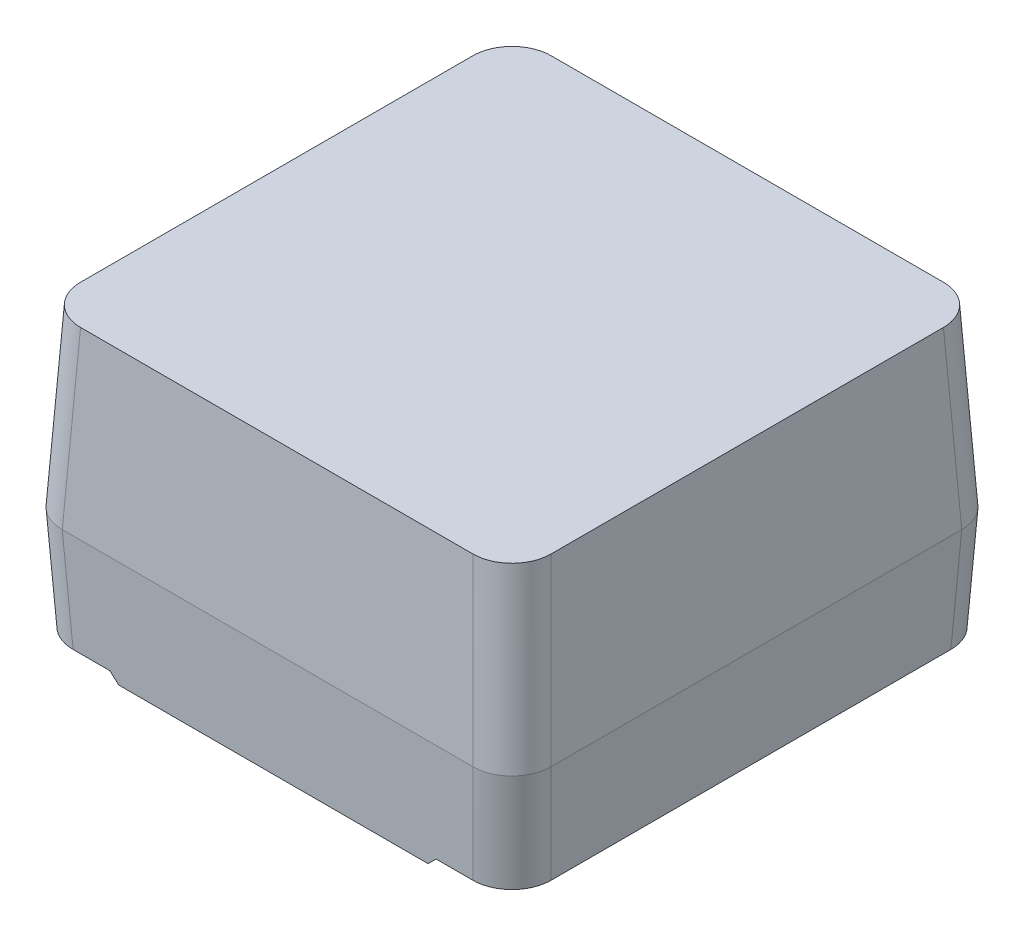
ISO-10303-21;
HEADER;
FILE_DESCRIPTION(('STEP AP214'),'2;1');
FILE_NAME('part.step','',(''),(''),'','','');
FILE_SCHEMA(('AUTOMOTIVE_DESIGN { 1 0 10303 214 1 1 1 1 }'));
ENDSEC;
DATA;
#1=APPLICATION_CONTEXT('core data for automotive mechanical design processes');
#2=APPLICATION_PROTOCOL_DEFINITION('international standard','automotive_design',2000,#1);
#3=PRODUCT_CONTEXT('',#1,'mechanical');
#4=PRODUCT('Part','Part','',(#3));
#5=PRODUCT_RELATED_PRODUCT_CATEGORY('part','',(#4));
#6=PRODUCT_DEFINITION_FORMATION('','',#4);
#7=PRODUCT_DEFINITION_CONTEXT('part definition',#1,'design');
#8=PRODUCT_DEFINITION('design','',#6,#7);
#9=PRODUCT_DEFINITION_SHAPE('','',#8);
#10=(LENGTH_UNIT() NAMED_UNIT(*) SI_UNIT(.MILLI.,.METRE.));
#11=(NAMED_UNIT(*) PLANE_ANGLE_UNIT() SI_UNIT($,.RADIAN.));
#12=(NAMED_UNIT(*) SI_UNIT($,.STERADIAN.) SOLID_ANGLE_UNIT());
#13=UNCERTAINTY_MEASURE_WITH_UNIT(LENGTH_MEASURE(1.E-05),#10,'distance_accuracy_value','');
#14=(GEOMETRIC_REPRESENTATION_CONTEXT(3) GLOBAL_UNCERTAINTY_ASSIGNED_CONTEXT((#13)) GLOBAL_UNIT_ASSIGNED_CONTEXT((#10,
#11,#12)) REPRESENTATION_CONTEXT('',''));
#15=CARTESIAN_POINT('',(0.,0.,0.));
#16=DIRECTION('',(0.,0.,1.));
#17=DIRECTION('',(1.,0.,0.));
#18=AXIS2_PLACEMENT_3D('',#15,#16,#17);
#19=CARTESIAN_POINT('',(-5.1435,0.,5.1435));
#20=DIRECTION('',(-0.998629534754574,-0.0523359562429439,0.));
#21=DIRECTION('',(0.052335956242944,-0.998629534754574,0.));
#22=AXIS2_PLACEMENT_3D('',#19,#20,#21);
#23=PLANE('',#22);
#24=DIRECTION('',(0.,0.,1.));
#25=VECTOR('',#24,1.);
#26=CARTESIAN_POINT('',(-5.02902044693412,-2.1844,5.1435));
#27=LINE('',#26,#25);
#28=CARTESIAN_POINT('',(-5.02902044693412,-2.1844,4.20465176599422));
#29=VERTEX_POINT('',#28);
#30=CARTESIAN_POINT('',(-5.02902044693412,-2.1844,-4.20465176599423));
#31=VERTEX_POINT('',#30);
#32=EDGE_CURVE('E175',#29,#31,#27,.F.);
#33=ORIENTED_EDGE('',*,*,#32,.F.);
#34=DIRECTION('',(0.052264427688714,-0.997264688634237,-0.0522644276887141));
#35=VECTOR('',#34,1.);
#36=CARTESIAN_POINT('',(-5.14575182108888,0.0429673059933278,4.32138314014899));
#37=LINE('',#36,#35);
#38=CARTESIAN_POINT('',(-5.1435,0.,4.3191313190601));
#39=VERTEX_POINT('',#38);
#40=EDGE_CURVE('E240',#29,#39,#37,.F.);
#41=ORIENTED_EDGE('',*,*,#40,.T.);
#42=DIRECTION('',(0.,0.,1.));
#43=VECTOR('',#42,1.);
#44=CARTESIAN_POINT('',(-5.1435,0.,5.1435));
#45=LINE('',#44,#43);
#46=CARTESIAN_POINT('',(-5.1435,0.,-4.3191313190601));
#47=VERTEX_POINT('',#46);
#48=EDGE_CURVE('E187',#47,#39,#45,.T.);
#49=ORIENTED_EDGE('',*,*,#48,.F.);
#50=DIRECTION('',(0.052264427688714,-0.997264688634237,0.0522644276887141));
#51=VECTOR('',#50,1.);
#52=CARTESIAN_POINT('',(-5.11765215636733,-0.493206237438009,-4.29328347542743));
#53=LINE('',#52,#51);
#54=EDGE_CURVE('E237',#47,#31,#53,.T.);
#55=ORIENTED_EDGE('',*,*,#54,.T.);
#56=EDGE_LOOP('',(#33,#41,#49,#55));
#57=FACE_BOUND('',#56,.T.);
#58=ADVANCED_FACE('F33',(#57),#23,.T.);
#59=CARTESIAN_POINT('',(-4.32138314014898,0.0861706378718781,4.32138314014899));
#60=DIRECTION('',(-0.052264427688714,0.997264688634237,0.052264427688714));
#61=DIRECTION('',(0.,-0.0523359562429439,0.998629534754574));
#62=AXIS2_PLACEMENT_3D('',#59,#60,#61);
#63=CYLINDRICAL_SURFACE('',#62,0.8255);
#64=ORIENTED_EDGE('',*,*,#40,.F.);
#65=CARTESIAN_POINT('',(-4.20238757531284,-2.1844,4.20238757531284));
#66=DIRECTION('',(0.,-1.,0.));
#67=DIRECTION('',(-0.707106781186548,0.,0.707106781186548));
#68=AXIS2_PLACEMENT_3D('',#65,#66,#67);
#69=ELLIPSE('',#68,0.82776419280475,0.8255);
#70=CARTESIAN_POINT('',(-4.20465176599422,-2.1844,5.02902044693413));
#71=VERTEX_POINT('',#70);
#72=EDGE_CURVE('E177',#29,#71,#69,.F.);
#73=ORIENTED_EDGE('',*,*,#72,.T.);
#74=DIRECTION('',(0.0522644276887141,-0.997264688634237,-0.052264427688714));
#75=VECTOR('',#74,1.);
#76=CARTESIAN_POINT('',(-4.32138314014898,0.0429673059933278,5.14575182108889));
#77=LINE('',#76,#75);
#78=CARTESIAN_POINT('',(-4.3191313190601,0.,5.1435));
#79=VERTEX_POINT('',#78);
#80=EDGE_CURVE('E211',#79,#71,#77,.T.);
#81=ORIENTED_EDGE('',*,*,#80,.F.);
#82=CARTESIAN_POINT('',(-4.31686712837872,0.,4.31686712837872));
#83=DIRECTION('',(0.,-1.,0.));
#84=DIRECTION('',(-0.707106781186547,0.,0.707106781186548));
#85=AXIS2_PLACEMENT_3D('',#82,#83,#84);
#86=ELLIPSE('',#85,0.82776419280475,0.8255);
#87=EDGE_CURVE('E258',#79,#39,#86,.T.);
#88=ORIENTED_EDGE('',*,*,#87,.T.);
#89=EDGE_LOOP('',(#64,#73,#81,#88));
#90=FACE_BOUND('',#89,.T.);
#91=ADVANCED_FACE('F291',(#90),#63,.T.);
#92=CARTESIAN_POINT('',(-4.32138314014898,0.0861706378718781,-4.32138314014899));
#93=DIRECTION('',(-0.052264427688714,0.997264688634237,-0.052264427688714));
#94=DIRECTION('',(0.,0.0523359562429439,0.998629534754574));
#95=AXIS2_PLACEMENT_3D('',#92,#93,#94);
#96=CYLINDRICAL_SURFACE('',#95,0.8255);
#97=DIRECTION('',(0.0522644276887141,-0.997264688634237,0.052264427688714));
#98=VECTOR('',#97,1.);
#99=CARTESIAN_POINT('',(-4.32138314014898,0.0429673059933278,-5.14575182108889));
#100=LINE('',#99,#98);
#101=CARTESIAN_POINT('',(-4.20465176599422,-2.1844,-5.02902044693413));
#102=VERTEX_POINT('',#101);
#103=CARTESIAN_POINT('',(-4.3191313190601,0.,-5.1435));
#104=VERTEX_POINT('',#103);
#105=EDGE_CURVE('E249',#102,#104,#100,.F.);
#106=ORIENTED_EDGE('',*,*,#105,.F.);
#107=CARTESIAN_POINT('',(-4.20238757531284,-2.1844,-4.20238757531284));
#108=DIRECTION('',(0.,-1.,0.));
#109=DIRECTION('',(-0.707106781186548,0.,-0.707106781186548));
#110=AXIS2_PLACEMENT_3D('',#107,#108,#109);
#111=ELLIPSE('',#110,0.82776419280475,0.8255);
#112=EDGE_CURVE('E267',#102,#31,#111,.F.);
#113=ORIENTED_EDGE('',*,*,#112,.T.);
#114=ORIENTED_EDGE('',*,*,#54,.F.);
#115=CARTESIAN_POINT('',(-4.31686712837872,0.,-4.31686712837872));
#116=DIRECTION('',(0.,-1.,0.));
#117=DIRECTION('',(-0.707106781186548,0.,-0.707106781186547));
#118=AXIS2_PLACEMENT_3D('',#115,#116,#117);
#119=ELLIPSE('',#118,0.82776419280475,0.8255);
#120=EDGE_CURVE('E261',#47,#104,#119,.T.);
#121=ORIENTED_EDGE('',*,*,#120,.T.);
#122=EDGE_LOOP('',(#106,#113,#114,#121));
#123=FACE_BOUND('',#122,.T.);
#124=ADVANCED_FACE('F308',(#123),#96,.T.);
#125=CARTESIAN_POINT('',(-5.1435,0.,5.1435));
#126=DIRECTION('',(-0.998629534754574,0.0523359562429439,0.));
#127=DIRECTION('',(-0.052335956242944,-0.998629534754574,0.));
#128=AXIS2_PLACEMENT_3D('',#125,#126,#127);
#129=PLANE('',#128);
#130=ORIENTED_EDGE('',*,*,#48,.T.);
#131=DIRECTION('',(0.052264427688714,0.997264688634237,-0.0522644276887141));
#132=VECTOR('',#131,1.);
#133=CARTESIAN_POINT('',(-5.14575182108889,-0.0429673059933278,4.32138314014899));
#134=LINE('',#133,#132);
#135=CARTESIAN_POINT('',(-4.95048214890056,3.683,4.12611346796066));
#136=VERTEX_POINT('',#135);
#137=EDGE_CURVE('E244',#39,#136,#134,.T.);
#138=ORIENTED_EDGE('',*,*,#137,.T.);
#139=DIRECTION('',(0.,0.,-1.));
#140=VECTOR('',#139,1.);
#141=CARTESIAN_POINT('',(-4.95048214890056,3.683,5.1435));
#142=LINE('',#141,#140);
#143=CARTESIAN_POINT('',(-4.95048214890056,3.683,-4.12611346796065));
#144=VERTEX_POINT('',#143);
#145=EDGE_CURVE('E199',#144,#136,#142,.F.);
#146=ORIENTED_EDGE('',*,*,#145,.F.);
#147=DIRECTION('',(0.052264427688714,0.997264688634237,0.052264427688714));
#148=VECTOR('',#147,1.);
#149=CARTESIAN_POINT('',(-5.11765215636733,0.493206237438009,-4.29328347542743));
#150=LINE('',#149,#148);
#151=EDGE_CURVE('E242',#144,#47,#150,.F.);
#152=ORIENTED_EDGE('',*,*,#151,.T.);
#153=EDGE_LOOP('',(#130,#138,#146,#152));
#154=FACE_BOUND('',#153,.T.);
#155=ADVANCED_FACE('F300',(#154),#129,.T.);
#156=CARTESIAN_POINT('',(5.1435,0.,5.1435));
#157=DIRECTION('',(0.,0.0523359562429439,0.998629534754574));
#158=DIRECTION('',(0.,-0.998629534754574,0.052335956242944));
#159=AXIS2_PLACEMENT_3D('',#156,#157,#158);
#160=PLANE('',#159);
#161=DIRECTION('',(1.,0.,0.));
#162=VECTOR('',#161,1.);
#163=CARTESIAN_POINT('',(5.1435,0.,5.1435));
#164=LINE('',#163,#162);
#165=CARTESIAN_POINT('',(4.3191313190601,0.,5.1435));
#166=VERTEX_POINT('',#165);
#167=EDGE_CURVE('E190',#79,#166,#164,.T.);
#168=ORIENTED_EDGE('',*,*,#167,.T.);
#169=DIRECTION('',(-0.0522644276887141,0.997264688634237,-0.052264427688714));
#170=VECTOR('',#169,1.);
#171=CARTESIAN_POINT('',(4.32138314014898,-0.0429673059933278,5.14575182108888));
#172=LINE('',#171,#170);
#173=CARTESIAN_POINT('',(4.12611346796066,3.683,4.95048214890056));
#174=VERTEX_POINT('',#173);
#175=EDGE_CURVE('E227',#166,#174,#172,.T.);
#176=ORIENTED_EDGE('',*,*,#175,.T.);
#177=DIRECTION('',(-1.,0.,0.));
#178=VECTOR('',#177,1.);
#179=CARTESIAN_POINT('',(5.1435,3.683,4.95048214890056));
#180=LINE('',#179,#178);
#181=CARTESIAN_POINT('',(-4.12611346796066,3.683,4.95048214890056));
#182=VERTEX_POINT('',#181);
#183=EDGE_CURVE('E202',#182,#174,#180,.F.);
#184=ORIENTED_EDGE('',*,*,#183,.F.);
#185=DIRECTION('',(0.052264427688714,0.997264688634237,-0.052264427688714));
#186=VECTOR('',#185,1.);
#187=CARTESIAN_POINT('',(-4.29328347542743,0.493206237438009,5.11765215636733));
#188=LINE('',#187,#186);
#189=EDGE_CURVE('E225',#182,#79,#188,.F.);
#190=ORIENTED_EDGE('',*,*,#189,.T.);
#191=EDGE_LOOP('',(#168,#176,#184,#190));
#192=FACE_BOUND('',#191,.T.);
#193=ADVANCED_FACE('F345',(#192),#160,.T.);
#194=CARTESIAN_POINT('',(5.1435,0.,5.1435));
#195=DIRECTION('',(0.998629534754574,0.0523359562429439,0.));
#196=DIRECTION('',(-0.052335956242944,0.998629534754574,0.));
#197=AXIS2_PLACEMENT_3D('',#194,#195,#196);
#198=PLANE('',#197);
#199=DIRECTION('',(0.,0.,1.));
#200=VECTOR('',#199,1.);
#201=CARTESIAN_POINT('',(4.95048214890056,3.683,5.1435));
#202=LINE('',#201,#200);
#203=CARTESIAN_POINT('',(4.95048214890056,3.683,4.12611346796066));
#204=VERTEX_POINT('',#203);
#205=CARTESIAN_POINT('',(4.95048214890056,3.683,-4.12611346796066));
#206=VERTEX_POINT('',#205);
#207=EDGE_CURVE('E205',#204,#206,#202,.F.);
#208=ORIENTED_EDGE('',*,*,#207,.F.);
#209=DIRECTION('',(-0.052264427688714,0.997264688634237,-0.052264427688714));
#210=VECTOR('',#209,1.);
#211=CARTESIAN_POINT('',(5.14575182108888,-0.0429673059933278,4.32138314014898));
#212=LINE('',#211,#210);
#213=CARTESIAN_POINT('',(5.1435,0.,4.3191313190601));
#214=VERTEX_POINT('',#213);
#215=EDGE_CURVE('E223',#204,#214,#212,.F.);
#216=ORIENTED_EDGE('',*,*,#215,.T.);
#217=DIRECTION('',(0.,0.,-1.));
#218=VECTOR('',#217,1.);
#219=CARTESIAN_POINT('',(5.1435,0.,5.1435));
#220=LINE('',#219,#218);
#221=CARTESIAN_POINT('',(5.1435,0.,-4.3191313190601));
#222=VERTEX_POINT('',#221);
#223=EDGE_CURVE('E193',#214,#222,#220,.T.);
#224=ORIENTED_EDGE('',*,*,#223,.T.);
#225=DIRECTION('',(-0.052264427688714,0.997264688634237,0.0522644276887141));
#226=VECTOR('',#225,1.);
#227=CARTESIAN_POINT('',(5.11765215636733,0.493206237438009,-4.29328347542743));
#228=LINE('',#227,#226);
#229=EDGE_CURVE('E221',#222,#206,#228,.T.);
#230=ORIENTED_EDGE('',*,*,#229,.T.);
#231=EDGE_LOOP('',(#208,#216,#224,#230));
#232=FACE_BOUND('',#231,.T.);
#233=ADVANCED_FACE('F331',(#232),#198,.T.);
#234=CARTESIAN_POINT('',(5.1435,0.,-5.1435));
#235=DIRECTION('',(0.,0.0523359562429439,-0.998629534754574));
#236=DIRECTION('',(0.,0.998629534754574,0.052335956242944));
#237=AXIS2_PLACEMENT_3D('',#234,#235,#236);
#238=PLANE('',#237);
#239=DIRECTION('',(-1.,0.,0.));
#240=VECTOR('',#239,1.);
#241=CARTESIAN_POINT('',(5.1435,0.,-5.1435));
#242=LINE('',#241,#240);
#243=CARTESIAN_POINT('',(4.3191313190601,0.,-5.1435));
#244=VERTEX_POINT('',#243);
#245=EDGE_CURVE('E196',#244,#104,#242,.T.);
#246=ORIENTED_EDGE('',*,*,#245,.T.);
#247=DIRECTION('',(0.0522644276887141,0.997264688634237,0.052264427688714));
#248=VECTOR('',#247,1.);
#249=CARTESIAN_POINT('',(-4.29328347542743,0.493206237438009,-5.11765215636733));
#250=LINE('',#249,#248);
#251=CARTESIAN_POINT('',(-4.12611346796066,3.683,-4.95048214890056));
#252=VERTEX_POINT('',#251);
#253=EDGE_CURVE('E253',#104,#252,#250,.T.);
#254=ORIENTED_EDGE('',*,*,#253,.T.);
#255=DIRECTION('',(1.,0.,0.));
#256=VECTOR('',#255,1.);
#257=CARTESIAN_POINT('',(5.1435,3.683,-4.95048214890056));
#258=LINE('',#257,#256);
#259=CARTESIAN_POINT('',(4.12611346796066,3.683,-4.95048214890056));
#260=VERTEX_POINT('',#259);
#261=EDGE_CURVE('E208',#260,#252,#258,.F.);
#262=ORIENTED_EDGE('',*,*,#261,.F.);
#263=DIRECTION('',(-0.052264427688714,0.997264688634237,0.052264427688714));
#264=VECTOR('',#263,1.);
#265=CARTESIAN_POINT('',(4.32138314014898,-0.0429673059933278,-5.14575182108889));
#266=LINE('',#265,#264);
#267=EDGE_CURVE('E251',#260,#244,#266,.F.);
#268=ORIENTED_EDGE('',*,*,#267,.T.);
#269=EDGE_LOOP('',(#246,#254,#262,#268));
#270=FACE_BOUND('',#269,.T.);
#271=ADVANCED_FACE('F316',(#270),#238,.T.);
#272=CARTESIAN_POINT('',(0.,3.683,0.));
#273=DIRECTION('',(0.,1.,0.));
#274=DIRECTION('',(0.,0.,1.));
#275=AXIS2_PLACEMENT_3D('',#272,#273,#274);
#276=PLANE('',#275);
#277=ORIENTED_EDGE('',*,*,#183,.T.);
#278=CARTESIAN_POINT('',(4.12384927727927,3.683,4.12384927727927));
#279=DIRECTION('',(0.,1.,0.));
#280=DIRECTION('',(0.707106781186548,0.,0.707106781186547));
#281=AXIS2_PLACEMENT_3D('',#278,#279,#280);
#282=ELLIPSE('',#281,0.82776419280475,0.8255);
#283=EDGE_CURVE('E235',#174,#204,#282,.T.);
#284=ORIENTED_EDGE('',*,*,#283,.T.);
#285=ORIENTED_EDGE('',*,*,#207,.T.);
#286=CARTESIAN_POINT('',(4.12384927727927,3.683,-4.12384927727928));
#287=DIRECTION('',(0.,1.,0.));
#288=DIRECTION('',(0.707106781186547,0.,-0.707106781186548));
#289=AXIS2_PLACEMENT_3D('',#286,#287,#288);
#290=ELLIPSE('',#289,0.82776419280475,0.8255);
#291=EDGE_CURVE('E229',#206,#260,#290,.T.);
#292=ORIENTED_EDGE('',*,*,#291,.T.);
#293=ORIENTED_EDGE('',*,*,#261,.T.);
#294=CARTESIAN_POINT('',(-4.12384927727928,3.683,-4.12384927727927));
#295=DIRECTION('',(0.,1.,0.));
#296=DIRECTION('',(-0.707106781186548,0.,-0.707106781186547));
#297=AXIS2_PLACEMENT_3D('',#294,#295,#296);
#298=ELLIPSE('',#297,0.82776419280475,0.8255);
#299=EDGE_CURVE('E231',#252,#144,#298,.T.);
#300=ORIENTED_EDGE('',*,*,#299,.T.);
#301=ORIENTED_EDGE('',*,*,#145,.T.);
#302=CARTESIAN_POINT('',(-4.12384927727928,3.683,4.12384927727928));
#303=DIRECTION('',(0.,1.,0.));
#304=DIRECTION('',(-0.707106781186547,0.,0.707106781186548));
#305=AXIS2_PLACEMENT_3D('',#302,#303,#304);
#306=ELLIPSE('',#305,0.82776419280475,0.8255);
#307=EDGE_CURVE('E233',#136,#182,#306,.T.);
#308=ORIENTED_EDGE('',*,*,#307,.T.);
#309=EDGE_LOOP('',(#277,#284,#285,#292,#293,#300,#301,#308));
#310=FACE_BOUND('',#309,.T.);
#311=ADVANCED_FACE('F347',(#310),#276,.T.);
#312=CARTESIAN_POINT('',(5.1435,0.,5.1435));
#313=DIRECTION('',(0.998629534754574,-0.0523359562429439,0.));
#314=DIRECTION('',(0.052335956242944,0.998629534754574,0.));
#315=AXIS2_PLACEMENT_3D('',#312,#313,#314);
#316=PLANE('',#315);
#317=DIRECTION('',(-0.052264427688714,-0.997264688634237,-0.0522644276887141));
#318=VECTOR('',#317,1.);
#319=CARTESIAN_POINT('',(5.14575182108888,0.0429673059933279,4.32138314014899));
#320=LINE('',#319,#318);
#321=CARTESIAN_POINT('',(5.02902044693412,-2.1844,4.20465176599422));
#322=VERTEX_POINT('',#321);
#323=EDGE_CURVE('E218',#214,#322,#320,.T.);
#324=ORIENTED_EDGE('',*,*,#323,.T.);
#325=DIRECTION('',(0.,0.,1.));
#326=VECTOR('',#325,1.);
#327=CARTESIAN_POINT('',(5.02902044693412,-2.1844,5.1435));
#328=LINE('',#327,#326);
#329=CARTESIAN_POINT('',(5.02902044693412,-2.1844,-4.20465176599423));
#330=VERTEX_POINT('',#329);
#331=EDGE_CURVE('E169',#322,#330,#328,.F.);
#332=ORIENTED_EDGE('',*,*,#331,.T.);
#333=DIRECTION('',(-0.052264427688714,-0.997264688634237,0.0522644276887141));
#334=VECTOR('',#333,1.);
#335=CARTESIAN_POINT('',(5.11765215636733,-0.493206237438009,-4.29328347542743));
#336=LINE('',#335,#334);
#337=EDGE_CURVE('E216',#330,#222,#336,.F.);
#338=ORIENTED_EDGE('',*,*,#337,.T.);
#339=ORIENTED_EDGE('',*,*,#223,.F.);
#340=EDGE_LOOP('',(#324,#332,#338,#339));
#341=FACE_BOUND('',#340,.T.);
#342=ADVANCED_FACE('F335',(#341),#316,.T.);
#343=CARTESIAN_POINT('',(-5.1435,0.,5.1435));
#344=DIRECTION('',(0.,-0.0523359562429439,0.998629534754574));
#345=DIRECTION('',(0.,-0.998629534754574,-0.052335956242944));
#346=AXIS2_PLACEMENT_3D('',#343,#344,#345);
#347=PLANE('',#346);
#348=DIRECTION('',(1.,0.,0.));
#349=VECTOR('',#348,1.);
#350=CARTESIAN_POINT('',(-5.1435,-2.3622,5.0197023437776));
#351=LINE('',#350,#349);
#352=CARTESIAN_POINT('',(3.2544023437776,-2.3622,5.0197023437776));
#353=VERTEX_POINT('',#352);
#354=CARTESIAN_POINT('',(-3.2544023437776,-2.3622,5.0197023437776));
#355=VERTEX_POINT('',#354);
#356=EDGE_CURVE('E148',#353,#355,#351,.F.);
#357=ORIENTED_EDGE('',*,*,#356,.F.);
#358=DIRECTION('',(-0.706621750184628,-0.706621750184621,-0.037032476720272));
#359=VECTOR('',#358,1.);
#360=CARTESIAN_POINT('',(3.13443666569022,-2.48216567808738,5.01341520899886));
#361=LINE('',#360,#359);
#362=CARTESIAN_POINT('',(3.4322023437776,-2.1844,5.02902044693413));
#363=VERTEX_POINT('',#362);
#364=EDGE_CURVE('E11',#353,#363,#361,.F.);
#365=ORIENTED_EDGE('',*,*,#364,.T.);
#366=DIRECTION('',(-1.,0.,0.));
#367=VECTOR('',#366,1.);
#368=CARTESIAN_POINT('',(-5.1435,-2.1844,5.02902044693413));
#369=LINE('',#368,#367);
#370=CARTESIAN_POINT('',(4.20465176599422,-2.1844,5.02902044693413));
#371=VERTEX_POINT('',#370);
#372=EDGE_CURVE('E146',#363,#371,#369,.F.);
#373=ORIENTED_EDGE('',*,*,#372,.T.);
#374=DIRECTION('',(-0.0522644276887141,-0.997264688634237,-0.052264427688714));
#375=VECTOR('',#374,1.);
#376=CARTESIAN_POINT('',(4.29328347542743,-0.493206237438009,5.11765215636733));
#377=LINE('',#376,#375);
#378=EDGE_CURVE('E214',#371,#166,#377,.F.);
#379=ORIENTED_EDGE('',*,*,#378,.T.);
#380=ORIENTED_EDGE('',*,*,#167,.F.);
#381=ORIENTED_EDGE('',*,*,#80,.T.);
#382=DIRECTION('',(1.,0.,0.));
#383=VECTOR('',#382,1.);
#384=CARTESIAN_POINT('',(-5.1435,-2.1844,5.02902044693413));
#385=LINE('',#384,#383);
#386=CARTESIAN_POINT('',(-3.4322023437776,-2.1844,5.02902044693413));
#387=VERTEX_POINT('',#386);
#388=EDGE_CURVE('E180',#387,#71,#385,.F.);
#389=ORIENTED_EDGE('',*,*,#388,.F.);
#390=DIRECTION('',(-0.706621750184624,0.706621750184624,0.0370324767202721));
#391=VECTOR('',#390,1.);
#392=CARTESIAN_POINT('',(-3.13443666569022,-2.48216567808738,5.01341520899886));
#393=LINE('',#392,#391);
#394=EDGE_CURVE('E41',#387,#355,#393,.F.);
#395=ORIENTED_EDGE('',*,*,#394,.T.);
#396=EDGE_LOOP('',(#357,#365,#373,#379,#380,#381,#389,#395));
#397=FACE_BOUND('',#396,.T.);
#398=ADVANCED_FACE('F145',(#397),#347,.T.);
#399=CARTESIAN_POINT('',(-5.1435,0.,-5.1435));
#400=DIRECTION('',(0.,-0.0523359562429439,-0.998629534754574));
#401=DIRECTION('',(0.,0.998629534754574,-0.052335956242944));
#402=AXIS2_PLACEMENT_3D('',#399,#400,#401);
#403=PLANE('',#402);
#404=DIRECTION('',(1.,0.,0.));
#405=VECTOR('',#404,1.);
#406=CARTESIAN_POINT('',(-5.1435,-2.1844,-5.02902044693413));
#407=LINE('',#406,#405);
#408=CARTESIAN_POINT('',(4.20465176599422,-2.1844,-5.02902044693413));
#409=VERTEX_POINT('',#408);
#410=CARTESIAN_POINT('',(3.4322023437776,-2.1844,-5.02902044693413));
#411=VERTEX_POINT('',#410);
#412=EDGE_CURVE('E165',#409,#411,#407,.F.);
#413=ORIENTED_EDGE('',*,*,#412,.T.);
#414=DIRECTION('',(0.706621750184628,0.706621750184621,-0.037032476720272));
#415=VECTOR('',#414,1.);
#416=CARTESIAN_POINT('',(3.46676967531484,-2.14983266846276,-5.03083204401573));
#417=LINE('',#416,#415);
#418=CARTESIAN_POINT('',(3.2544023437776,-2.3622,-5.0197023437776));
#419=VERTEX_POINT('',#418);
#420=EDGE_CURVE('E161',#411,#419,#417,.F.);
#421=ORIENTED_EDGE('',*,*,#420,.T.);
#422=DIRECTION('',(-1.,0.,0.));
#423=VECTOR('',#422,1.);
#424=CARTESIAN_POINT('',(-5.1435,-2.3622,-5.0197023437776));
#425=LINE('',#424,#423);
#426=CARTESIAN_POINT('',(-3.2544023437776,-2.3622,-5.0197023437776));
#427=VERTEX_POINT('',#426);
#428=EDGE_CURVE('E184',#427,#419,#425,.F.);
#429=ORIENTED_EDGE('',*,*,#428,.F.);
#430=DIRECTION('',(0.706621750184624,-0.706621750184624,0.0370324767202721));
#431=VECTOR('',#430,1.);
#432=CARTESIAN_POINT('',(-3.46676967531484,-2.14983266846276,-5.03083204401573));
#433=LINE('',#432,#431);
#434=CARTESIAN_POINT('',(-3.4322023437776,-2.1844,-5.02902044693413));
#435=VERTEX_POINT('',#434);
#436=EDGE_CURVE('E270',#427,#435,#433,.F.);
#437=ORIENTED_EDGE('',*,*,#436,.T.);
#438=DIRECTION('',(-1.,0.,0.));
#439=VECTOR('',#438,1.);
#440=CARTESIAN_POINT('',(-5.1435,-2.1844,-5.02902044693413));
#441=LINE('',#440,#439);
#442=EDGE_CURVE('E158',#102,#435,#441,.F.);
#443=ORIENTED_EDGE('',*,*,#442,.F.);
#444=ORIENTED_EDGE('',*,*,#105,.T.);
#445=ORIENTED_EDGE('',*,*,#245,.F.);
#446=DIRECTION('',(-0.0522644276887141,-0.997264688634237,0.052264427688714));
#447=VECTOR('',#446,1.);
#448=CARTESIAN_POINT('',(4.29328347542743,-0.493206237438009,-5.11765215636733));
#449=LINE('',#448,#447);
#450=EDGE_CURVE('E246',#244,#409,#449,.T.);
#451=ORIENTED_EDGE('',*,*,#450,.T.);
#452=EDGE_LOOP('',(#413,#421,#429,#437,#443,#444,#445,#451));
#453=FACE_BOUND('',#452,.T.);
#454=ADVANCED_FACE('F281',(#453),#403,.T.);
#455=CARTESIAN_POINT('',(0.,-2.3622,0.));
#456=DIRECTION('',(0.,-1.,0.));
#457=DIRECTION('',(0.,0.,-1.));
#458=AXIS2_PLACEMENT_3D('',#455,#456,#457);
#459=PLANE('',#458);
#460=ORIENTED_EDGE('',*,*,#428,.T.);
#461=DIRECTION('',(0.,0.,1.));
#462=VECTOR('',#461,1.);
#463=CARTESIAN_POINT('',(3.2544023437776,-2.3622,5.0197023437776));
#464=LINE('',#463,#462);
#465=EDGE_CURVE('E54',#419,#353,#464,.T.);
#466=ORIENTED_EDGE('',*,*,#465,.T.);
#467=ORIENTED_EDGE('',*,*,#356,.T.);
#468=DIRECTION('',(0.,0.,-1.));
#469=VECTOR('',#468,1.);
#470=CARTESIAN_POINT('',(-3.2544023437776,-2.3622,-5.0197023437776));
#471=LINE('',#470,#469);
#472=EDGE_CURVE('E273',#355,#427,#471,.T.);
#473=ORIENTED_EDGE('',*,*,#472,.T.);
#474=EDGE_LOOP('',(#460,#466,#467,#473));
#475=FACE_BOUND('',#474,.T.);
#476=ADVANCED_FACE('F277',(#475),#459,.T.);
#477=CARTESIAN_POINT('',(4.32138314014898,-0.0861706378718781,4.32138314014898));
#478=DIRECTION('',(0.052264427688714,-0.997264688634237,0.052264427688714));
#479=DIRECTION('',(0.998629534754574,0.0523359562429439,0.));
#480=AXIS2_PLACEMENT_3D('',#477,#478,#479);
#481=CYLINDRICAL_SURFACE('',#480,0.8255);
#482=ORIENTED_EDGE('',*,*,#283,.F.);
#483=ORIENTED_EDGE('',*,*,#175,.F.);
#484=CARTESIAN_POINT('',(4.31686712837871,0.,4.31686712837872));
#485=DIRECTION('',(0.,-1.,0.));
#486=DIRECTION('',(0.707106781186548,0.,0.707106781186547));
#487=AXIS2_PLACEMENT_3D('',#484,#485,#486);
#488=ELLIPSE('',#487,0.82776419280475,0.8255);
#489=EDGE_CURVE('E185',#214,#166,#488,.T.);
#490=ORIENTED_EDGE('',*,*,#489,.F.);
#491=ORIENTED_EDGE('',*,*,#215,.F.);
#492=EDGE_LOOP('',(#482,#483,#490,#491));
#493=FACE_BOUND('',#492,.T.);
#494=ADVANCED_FACE('F342',(#493),#481,.T.);
#495=CARTESIAN_POINT('',(4.29328347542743,-0.450002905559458,4.29328347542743));
#496=DIRECTION('',(0.052264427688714,0.997264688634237,0.052264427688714));
#497=DIRECTION('',(0.,-0.0523359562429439,0.998629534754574));
#498=AXIS2_PLACEMENT_3D('',#495,#496,#497);
#499=CYLINDRICAL_SURFACE('',#498,0.8255);
#500=CARTESIAN_POINT('',(4.20238757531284,-2.1844,4.20238757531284));
#501=DIRECTION('',(0.,1.,0.));
#502=DIRECTION('',(0.707106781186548,0.,0.707106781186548));
#503=AXIS2_PLACEMENT_3D('',#500,#501,#502);
#504=ELLIPSE('',#503,0.82776419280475,0.8255);
#505=EDGE_CURVE('E157',#322,#371,#504,.F.);
#506=ORIENTED_EDGE('',*,*,#505,.F.);
#507=ORIENTED_EDGE('',*,*,#323,.F.);
#508=ORIENTED_EDGE('',*,*,#489,.T.);
#509=ORIENTED_EDGE('',*,*,#378,.F.);
#510=EDGE_LOOP('',(#506,#507,#508,#509));
#511=FACE_BOUND('',#510,.T.);
#512=ADVANCED_FACE('F338',(#511),#499,.T.);
#513=CARTESIAN_POINT('',(-4.29328347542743,0.450002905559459,4.29328347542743));
#514=DIRECTION('',(-0.052264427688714,-0.997264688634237,0.052264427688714));
#515=DIRECTION('',(0.,-0.052335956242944,-0.998629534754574));
#516=AXIS2_PLACEMENT_3D('',#513,#514,#515);
#517=CYLINDRICAL_SURFACE('',#516,0.8255);
#518=ORIENTED_EDGE('',*,*,#307,.F.);
#519=ORIENTED_EDGE('',*,*,#137,.F.);
#520=ORIENTED_EDGE('',*,*,#87,.F.);
#521=ORIENTED_EDGE('',*,*,#189,.F.);
#522=EDGE_LOOP('',(#518,#519,#520,#521));
#523=FACE_BOUND('',#522,.T.);
#524=ADVANCED_FACE('F296',(#523),#517,.T.);
#525=CARTESIAN_POINT('',(-4.29328347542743,0.450002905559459,-4.29328347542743));
#526=DIRECTION('',(-0.052264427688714,-0.997264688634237,-0.052264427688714));
#527=DIRECTION('',(0.998629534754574,-0.0523359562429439,0.));
#528=AXIS2_PLACEMENT_3D('',#525,#526,#527);
#529=CYLINDRICAL_SURFACE('',#528,0.8255);
#530=ORIENTED_EDGE('',*,*,#299,.F.);
#531=ORIENTED_EDGE('',*,*,#253,.F.);
#532=ORIENTED_EDGE('',*,*,#120,.F.);
#533=ORIENTED_EDGE('',*,*,#151,.F.);
#534=EDGE_LOOP('',(#530,#531,#532,#533));
#535=FACE_BOUND('',#534,.T.);
#536=ADVANCED_FACE('F312',(#535),#529,.T.);
#537=CARTESIAN_POINT('',(4.32138314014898,-0.0861706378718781,-4.32138314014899));
#538=DIRECTION('',(0.052264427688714,-0.997264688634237,-0.052264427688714));
#539=DIRECTION('',(0.,0.052335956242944,-0.998629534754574));
#540=AXIS2_PLACEMENT_3D('',#537,#538,#539);
#541=CYLINDRICAL_SURFACE('',#540,0.8255);
#542=ORIENTED_EDGE('',*,*,#291,.F.);
#543=ORIENTED_EDGE('',*,*,#229,.F.);
#544=CARTESIAN_POINT('',(4.31686712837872,0.,-4.31686712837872));
#545=DIRECTION('',(0.,-1.,0.));
#546=DIRECTION('',(0.707106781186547,0.,-0.707106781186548));
#547=AXIS2_PLACEMENT_3D('',#544,#545,#546);
#548=ELLIPSE('',#547,0.82776419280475,0.8255);
#549=EDGE_CURVE('E182',#244,#222,#548,.T.);
#550=ORIENTED_EDGE('',*,*,#549,.F.);
#551=ORIENTED_EDGE('',*,*,#267,.F.);
#552=EDGE_LOOP('',(#542,#543,#550,#551));
#553=FACE_BOUND('',#552,.T.);
#554=ADVANCED_FACE('F327',(#553),#541,.T.);
#555=CARTESIAN_POINT('',(4.29328347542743,-0.450002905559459,-4.29328347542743));
#556=DIRECTION('',(0.052264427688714,0.997264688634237,-0.052264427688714));
#557=DIRECTION('',(0.,0.0523359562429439,0.998629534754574));
#558=AXIS2_PLACEMENT_3D('',#555,#556,#557);
#559=CYLINDRICAL_SURFACE('',#558,0.8255);
#560=CARTESIAN_POINT('',(4.20238757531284,-2.1844,-4.20238757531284));
#561=DIRECTION('',(0.,1.,0.));
#562=DIRECTION('',(0.707106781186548,0.,-0.707106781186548));
#563=AXIS2_PLACEMENT_3D('',#560,#561,#562);
#564=ELLIPSE('',#563,0.82776419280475,0.8255);
#565=EDGE_CURVE('E255',#409,#330,#564,.F.);
#566=ORIENTED_EDGE('',*,*,#565,.F.);
#567=ORIENTED_EDGE('',*,*,#450,.F.);
#568=ORIENTED_EDGE('',*,*,#549,.T.);
#569=ORIENTED_EDGE('',*,*,#337,.F.);
#570=EDGE_LOOP('',(#566,#567,#568,#569));
#571=FACE_BOUND('',#570,.T.);
#572=ADVANCED_FACE('F322',(#571),#559,.T.);
#573=CARTESIAN_POINT('',(0.,-2.1844,0.));
#574=DIRECTION('',(0.,1.,0.));
#575=DIRECTION('',(0.,0.,1.));
#576=AXIS2_PLACEMENT_3D('',#573,#574,#575);
#577=PLANE('',#576);
#578=DIRECTION('',(0.,0.,-1.));
#579=VECTOR('',#578,1.);
#580=CARTESIAN_POINT('',(3.4322023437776,-2.1844,-6.35));
#581=LINE('',#580,#579);
#582=EDGE_CURVE('E154',#363,#411,#581,.T.);
#583=ORIENTED_EDGE('',*,*,#582,.T.);
#584=ORIENTED_EDGE('',*,*,#412,.F.);
#585=ORIENTED_EDGE('',*,*,#565,.T.);
#586=ORIENTED_EDGE('',*,*,#331,.F.);
#587=ORIENTED_EDGE('',*,*,#505,.T.);
#588=ORIENTED_EDGE('',*,*,#372,.F.);
#589=EDGE_LOOP('',(#583,#584,#585,#586,#587,#588));
#590=FACE_BOUND('',#589,.T.);
#591=ADVANCED_FACE('F153',(#590),#577,.F.);
#592=CARTESIAN_POINT('',(0.,-2.1844,0.));
#593=DIRECTION('',(0.,-1.,0.));
#594=DIRECTION('',(0.,0.,-1.));
#595=AXIS2_PLACEMENT_3D('',#592,#593,#594);
#596=PLANE('',#595);
#597=ORIENTED_EDGE('',*,*,#388,.T.);
#598=ORIENTED_EDGE('',*,*,#72,.F.);
#599=ORIENTED_EDGE('',*,*,#32,.T.);
#600=ORIENTED_EDGE('',*,*,#112,.F.);
#601=ORIENTED_EDGE('',*,*,#442,.T.);
#602=DIRECTION('',(0.,0.,1.));
#603=VECTOR('',#602,1.);
#604=CARTESIAN_POINT('',(-3.4322023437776,-2.1844,-6.35));
#605=LINE('',#604,#603);
#606=EDGE_CURVE('E162',#435,#387,#605,.T.);
#607=ORIENTED_EDGE('',*,*,#606,.T.);
#608=EDGE_LOOP('',(#597,#598,#599,#600,#601,#607));
#609=FACE_BOUND('',#608,.T.);
#610=ADVANCED_FACE('F285',(#609),#596,.T.);
#611=CARTESIAN_POINT('',(3.4322023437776,-2.1844,-6.35));
#612=DIRECTION('',(0.707106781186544,-0.707106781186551,0.));
#613=DIRECTION('',(0.,0.,1.));
#614=AXIS2_PLACEMENT_3D('',#611,#612,#613);
#615=PLANE('',#614);
#616=ORIENTED_EDGE('',*,*,#364,.F.);
#617=ORIENTED_EDGE('',*,*,#465,.F.);
#618=ORIENTED_EDGE('',*,*,#420,.F.);
#619=ORIENTED_EDGE('',*,*,#582,.F.);
#620=EDGE_LOOP('',(#616,#617,#618,#619));
#621=FACE_BOUND('',#620,.T.);
#622=ADVANCED_FACE('F160',(#621),#615,.T.);
#623=CARTESIAN_POINT('',(-3.4322023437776,-2.1844,-6.35));
#624=DIRECTION('',(-0.707106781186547,-0.707106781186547,0.));
#625=DIRECTION('',(0.,0.,-1.));
#626=AXIS2_PLACEMENT_3D('',#623,#624,#625);
#627=PLANE('',#626);
#628=ORIENTED_EDGE('',*,*,#436,.F.);
#629=ORIENTED_EDGE('',*,*,#472,.F.);
#630=ORIENTED_EDGE('',*,*,#394,.F.);
#631=ORIENTED_EDGE('',*,*,#606,.F.);
#632=EDGE_LOOP('',(#628,#629,#630,#631));
#633=FACE_BOUND('',#632,.T.);
#634=ADVANCED_FACE('F35',(#633),#627,.T.);
#635=CLOSED_SHELL('',(#58,#91,#124,#155,#193,#233,#271,#311,#342,#398,#454,#476,#494,#512,#524,
#536,#554,#572,#591,#610,#622,#634));
#636=MANIFOLD_SOLID_BREP('B2',#635);
#637=ADVANCED_BREP_SHAPE_REPRESENTATION('',(#18,#636),#14);
#638=SHAPE_DEFINITION_REPRESENTATION(#9,#637);
ENDSEC;
END-ISO-10303-21;
